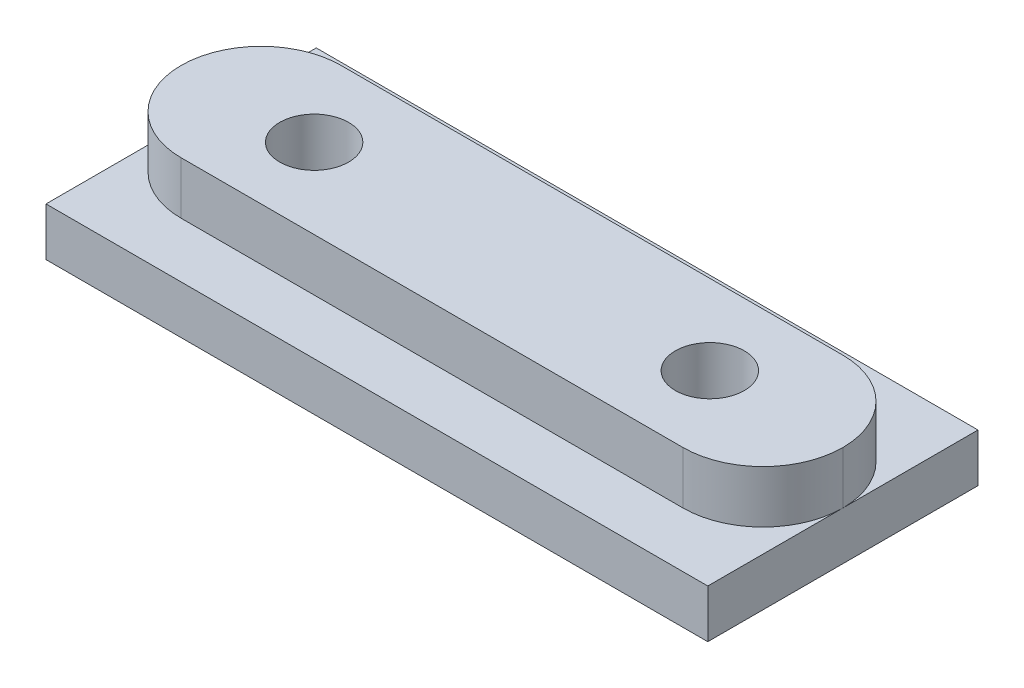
ISO-10303-21;
HEADER;
FILE_DESCRIPTION(('STEP AP214'),'2;1');
FILE_NAME('part.step','',(''),(''),'','','');
FILE_SCHEMA(('AUTOMOTIVE_DESIGN { 1 0 10303 214 1 1 1 1 }'));
ENDSEC;
DATA;
#1=APPLICATION_CONTEXT('core data for automotive mechanical design processes');
#2=APPLICATION_PROTOCOL_DEFINITION('international standard','automotive_design',2000,#1);
#3=PRODUCT_CONTEXT('',#1,'mechanical');
#4=PRODUCT('Part','Part','',(#3));
#5=PRODUCT_RELATED_PRODUCT_CATEGORY('part','',(#4));
#6=PRODUCT_DEFINITION_FORMATION('','',#4);
#7=PRODUCT_DEFINITION_CONTEXT('part definition',#1,'design');
#8=PRODUCT_DEFINITION('design','',#6,#7);
#9=PRODUCT_DEFINITION_SHAPE('','',#8);
#10=(LENGTH_UNIT() NAMED_UNIT(*) SI_UNIT(.MILLI.,.METRE.));
#11=(NAMED_UNIT(*) PLANE_ANGLE_UNIT() SI_UNIT($,.RADIAN.));
#12=(NAMED_UNIT(*) SI_UNIT($,.STERADIAN.) SOLID_ANGLE_UNIT());
#13=UNCERTAINTY_MEASURE_WITH_UNIT(LENGTH_MEASURE(1.E-05),#10,'distance_accuracy_value','');
#14=(GEOMETRIC_REPRESENTATION_CONTEXT(3) GLOBAL_UNCERTAINTY_ASSIGNED_CONTEXT((#13)) GLOBAL_UNIT_ASSIGNED_CONTEXT((#10,
#11,#12)) REPRESENTATION_CONTEXT('',''));
#15=CARTESIAN_POINT('',(0.,0.,0.));
#16=DIRECTION('',(0.,0.,1.));
#17=DIRECTION('',(1.,0.,0.));
#18=AXIS2_PLACEMENT_3D('',#15,#16,#17);
#19=CARTESIAN_POINT('',(24.,1.75,0.));
#20=DIRECTION('',(0.,0.,-1.));
#21=DIRECTION('',(-1.,0.,0.));
#22=AXIS2_PLACEMENT_3D('',#19,#20,#21);
#23=PLANE('',#22);
#24=DIRECTION('',(0.,-1.,0.));
#25=VECTOR('',#24,1.);
#26=CARTESIAN_POINT('',(0.,1.75,0.));
#27=LINE('',#26,#25);
#28=CARTESIAN_POINT('',(0.,1.75,0.));
#29=VERTEX_POINT('',#28);
#30=CARTESIAN_POINT('',(0.,0.,0.));
#31=VERTEX_POINT('',#30);
#32=EDGE_CURVE('E134',#29,#31,#27,.T.);
#33=ORIENTED_EDGE('',*,*,#32,.T.);
#34=DIRECTION('',(-1.,0.,0.));
#35=VECTOR('',#34,1.);
#36=CARTESIAN_POINT('',(24.,0.,0.));
#37=LINE('',#36,#35);
#38=CARTESIAN_POINT('',(24.,0.,0.));
#39=VERTEX_POINT('',#38);
#40=EDGE_CURVE('E118',#39,#31,#37,.T.);
#41=ORIENTED_EDGE('',*,*,#40,.F.);
#42=DIRECTION('',(0.,-1.,0.));
#43=VECTOR('',#42,1.);
#44=CARTESIAN_POINT('',(24.,1.75,0.));
#45=LINE('',#44,#43);
#46=CARTESIAN_POINT('',(24.,1.75,0.));
#47=VERTEX_POINT('',#46);
#48=EDGE_CURVE('E125',#47,#39,#45,.T.);
#49=ORIENTED_EDGE('',*,*,#48,.F.);
#50=DIRECTION('',(-1.,0.,0.));
#51=VECTOR('',#50,1.);
#52=CARTESIAN_POINT('',(24.,1.75,0.));
#53=LINE('',#52,#51);
#54=EDGE_CURVE('E188',#47,#29,#53,.T.);
#55=ORIENTED_EDGE('',*,*,#54,.T.);
#56=EDGE_LOOP('',(#33,#41,#49,#55));
#57=FACE_BOUND('',#56,.T.);
#58=ADVANCED_FACE('F34',(#57),#23,.F.);
#59=CARTESIAN_POINT('',(24.,0.,0.));
#60=DIRECTION('',(0.,1.,0.));
#61=DIRECTION('',(0.,0.,1.));
#62=AXIS2_PLACEMENT_3D('',#59,#60,#61);
#63=PLANE('',#62);
#64=CARTESIAN_POINT('',(4.825,0.,-4.9));
#65=DIRECTION('',(0.,1.,0.));
#66=DIRECTION('',(0.,0.,1.));
#67=AXIS2_PLACEMENT_3D('',#64,#65,#66);
#68=CIRCLE('',#67,1.25);
#69=CARTESIAN_POINT('',(4.825,0.,-3.65));
#70=VERTEX_POINT('',#69);
#71=EDGE_CURVE('E170',#70,#70,#68,.T.);
#72=ORIENTED_EDGE('',*,*,#71,.T.);
#73=EDGE_LOOP('',(#72));
#74=FACE_BOUND('',#73,.T.);
#75=CARTESIAN_POINT('',(19.175,0.,-4.9));
#76=DIRECTION('',(0.,1.,0.));
#77=DIRECTION('',(0.,0.,1.));
#78=AXIS2_PLACEMENT_3D('',#75,#76,#77);
#79=CIRCLE('',#78,1.25);
#80=CARTESIAN_POINT('',(19.175,0.,-3.65));
#81=VERTEX_POINT('',#80);
#82=EDGE_CURVE('E219',#81,#81,#79,.T.);
#83=ORIENTED_EDGE('',*,*,#82,.T.);
#84=EDGE_LOOP('',(#83));
#85=FACE_BOUND('',#84,.T.);
#86=DIRECTION('',(0.,0.,-1.));
#87=VECTOR('',#86,1.);
#88=CARTESIAN_POINT('',(0.,0.,0.));
#89=LINE('',#88,#87);
#90=CARTESIAN_POINT('',(0.,0.,-9.8));
#91=VERTEX_POINT('',#90);
#92=EDGE_CURVE('E214',#31,#91,#89,.T.);
#93=ORIENTED_EDGE('',*,*,#92,.T.);
#94=DIRECTION('',(-1.,0.,0.));
#95=VECTOR('',#94,1.);
#96=CARTESIAN_POINT('',(24.,0.,-9.8));
#97=LINE('',#96,#95);
#98=CARTESIAN_POINT('',(24.,0.,-9.8));
#99=VERTEX_POINT('',#98);
#100=EDGE_CURVE('E121',#99,#91,#97,.T.);
#101=ORIENTED_EDGE('',*,*,#100,.F.);
#102=DIRECTION('',(0.,0.,-1.));
#103=VECTOR('',#102,1.);
#104=CARTESIAN_POINT('',(24.,0.,0.));
#105=LINE('',#104,#103);
#106=EDGE_CURVE('E114',#39,#99,#105,.T.);
#107=ORIENTED_EDGE('',*,*,#106,.F.);
#108=ORIENTED_EDGE('',*,*,#40,.T.);
#109=EDGE_LOOP('',(#93,#101,#107,#108));
#110=FACE_BOUND('',#109,.T.);
#111=ADVANCED_FACE('F116',(#74,#85,#110),#63,.F.);
#112=CARTESIAN_POINT('',(24.,0.,-9.8));
#113=DIRECTION('',(0.,0.,1.));
#114=DIRECTION('',(0.,-1.,0.));
#115=AXIS2_PLACEMENT_3D('',#112,#113,#114);
#116=PLANE('',#115);
#117=DIRECTION('',(0.,1.,0.));
#118=VECTOR('',#117,1.);
#119=CARTESIAN_POINT('',(0.,0.,-9.8));
#120=LINE('',#119,#118);
#121=CARTESIAN_POINT('',(0.,1.75,-9.8));
#122=VERTEX_POINT('',#121);
#123=EDGE_CURVE('E212',#91,#122,#120,.T.);
#124=ORIENTED_EDGE('',*,*,#123,.T.);
#125=DIRECTION('',(-1.,0.,0.));
#126=VECTOR('',#125,1.);
#127=CARTESIAN_POINT('',(24.,1.75,-9.8));
#128=LINE('',#127,#126);
#129=CARTESIAN_POINT('',(24.,1.75,-9.8));
#130=VERTEX_POINT('',#129);
#131=EDGE_CURVE('E140',#130,#122,#128,.T.);
#132=ORIENTED_EDGE('',*,*,#131,.F.);
#133=DIRECTION('',(0.,1.,0.));
#134=VECTOR('',#133,1.);
#135=CARTESIAN_POINT('',(24.,0.,-9.8));
#136=LINE('',#135,#134);
#137=EDGE_CURVE('E124',#99,#130,#136,.T.);
#138=ORIENTED_EDGE('',*,*,#137,.F.);
#139=ORIENTED_EDGE('',*,*,#100,.T.);
#140=EDGE_LOOP('',(#124,#132,#138,#139));
#141=FACE_BOUND('',#140,.T.);
#142=ADVANCED_FACE('F267',(#141),#116,.F.);
#143=CARTESIAN_POINT('',(24.,1.75,-7.8));
#144=DIRECTION('',(0.,-1.,0.));
#145=DIRECTION('',(0.,0.,-1.));
#146=AXIS2_PLACEMENT_3D('',#143,#144,#145);
#147=PLANE('',#146);
#148=DIRECTION('',(0.,0.,1.));
#149=VECTOR('',#148,1.);
#150=CARTESIAN_POINT('',(0.,1.75,-7.8));
#151=LINE('',#150,#149);
#152=CARTESIAN_POINT('',(0.,1.75,-4.9));
#153=VERTEX_POINT('',#152);
#154=EDGE_CURVE('E206',#122,#153,#151,.T.);
#155=ORIENTED_EDGE('',*,*,#154,.T.);
#156=CARTESIAN_POINT('',(2.9,1.75,-4.9));
#157=DIRECTION('',(0.,-1.,0.));
#158=DIRECTION('',(0.,0.,-1.));
#159=AXIS2_PLACEMENT_3D('',#156,#157,#158);
#160=CIRCLE('',#159,2.9);
#161=CARTESIAN_POINT('',(2.9,1.75,-7.8));
#162=VERTEX_POINT('',#161);
#163=EDGE_CURVE('E157',#153,#162,#160,.T.);
#164=ORIENTED_EDGE('',*,*,#163,.T.);
#165=DIRECTION('',(-1.,0.,0.));
#166=VECTOR('',#165,1.);
#167=CARTESIAN_POINT('',(24.,1.75,-7.8));
#168=LINE('',#167,#166);
#169=CARTESIAN_POINT('',(21.1,1.75,-7.8));
#170=VERTEX_POINT('',#169);
#171=EDGE_CURVE('E197',#170,#162,#168,.T.);
#172=ORIENTED_EDGE('',*,*,#171,.F.);
#173=CARTESIAN_POINT('',(21.1,1.75,-4.9));
#174=DIRECTION('',(0.,-1.,0.));
#175=DIRECTION('',(0.,0.,-1.));
#176=AXIS2_PLACEMENT_3D('',#173,#174,#175);
#177=CIRCLE('',#176,2.9);
#178=CARTESIAN_POINT('',(24.,1.75,-4.9));
#179=VERTEX_POINT('',#178);
#180=EDGE_CURVE('E43',#170,#179,#177,.T.);
#181=ORIENTED_EDGE('',*,*,#180,.T.);
#182=DIRECTION('',(0.,0.,1.));
#183=VECTOR('',#182,1.);
#184=CARTESIAN_POINT('',(24.,1.75,-7.8));
#185=LINE('',#184,#183);
#186=EDGE_CURVE('E207',#130,#179,#185,.T.);
#187=ORIENTED_EDGE('',*,*,#186,.F.);
#188=ORIENTED_EDGE('',*,*,#131,.T.);
#189=EDGE_LOOP('',(#155,#164,#172,#181,#187,#188));
#190=FACE_BOUND('',#189,.T.);
#191=ADVANCED_FACE('F205',(#190),#147,.F.);
#192=CARTESIAN_POINT('',(24.,3.65,-7.8));
#193=DIRECTION('',(0.,0.,1.));
#194=DIRECTION('',(1.,0.,0.));
#195=AXIS2_PLACEMENT_3D('',#192,#193,#194);
#196=PLANE('',#195);
#197=ORIENTED_EDGE('',*,*,#171,.T.);
#198=DIRECTION('',(0.,1.,0.));
#199=VECTOR('',#198,1.);
#200=CARTESIAN_POINT('',(2.9,3.65,-7.8));
#201=LINE('',#200,#199);
#202=CARTESIAN_POINT('',(2.9,3.65,-7.8));
#203=VERTEX_POINT('',#202);
#204=EDGE_CURVE('E138',#162,#203,#201,.T.);
#205=ORIENTED_EDGE('',*,*,#204,.T.);
#206=DIRECTION('',(-1.,0.,0.));
#207=VECTOR('',#206,1.);
#208=CARTESIAN_POINT('',(24.,3.65,-7.8));
#209=LINE('',#208,#207);
#210=CARTESIAN_POINT('',(21.1,3.65,-7.8));
#211=VERTEX_POINT('',#210);
#212=EDGE_CURVE('E190',#211,#203,#209,.T.);
#213=ORIENTED_EDGE('',*,*,#212,.F.);
#214=DIRECTION('',(0.,1.,0.));
#215=VECTOR('',#214,1.);
#216=CARTESIAN_POINT('',(21.1,1.75,-7.8));
#217=LINE('',#216,#215);
#218=EDGE_CURVE('E135',#211,#170,#217,.F.);
#219=ORIENTED_EDGE('',*,*,#218,.T.);
#220=EDGE_LOOP('',(#197,#205,#213,#219));
#221=FACE_BOUND('',#220,.T.);
#222=ADVANCED_FACE('F244',(#221),#196,.F.);
#223=CARTESIAN_POINT('',(24.,3.65,-2.));
#224=DIRECTION('',(0.,-1.,0.));
#225=DIRECTION('',(0.,0.,-1.));
#226=AXIS2_PLACEMENT_3D('',#223,#224,#225);
#227=PLANE('',#226);
#228=CARTESIAN_POINT('',(4.825,3.65,-4.9));
#229=DIRECTION('',(0.,1.,0.));
#230=DIRECTION('',(0.,0.,1.));
#231=AXIS2_PLACEMENT_3D('',#228,#229,#230);
#232=CIRCLE('',#231,1.24999999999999);
#233=CARTESIAN_POINT('',(4.825,3.65,-3.65000000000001));
#234=VERTEX_POINT('',#233);
#235=EDGE_CURVE('E165',#234,#234,#232,.T.);
#236=ORIENTED_EDGE('',*,*,#235,.F.);
#237=EDGE_LOOP('',(#236));
#238=FACE_BOUND('',#237,.T.);
#239=CARTESIAN_POINT('',(19.175,3.65,-4.9));
#240=DIRECTION('',(0.,1.,0.));
#241=DIRECTION('',(0.,0.,1.));
#242=AXIS2_PLACEMENT_3D('',#239,#240,#241);
#243=CIRCLE('',#242,1.24999999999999);
#244=CARTESIAN_POINT('',(19.175,3.65,-3.65000000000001));
#245=VERTEX_POINT('',#244);
#246=EDGE_CURVE('E225',#245,#245,#243,.T.);
#247=ORIENTED_EDGE('',*,*,#246,.F.);
#248=EDGE_LOOP('',(#247));
#249=FACE_BOUND('',#248,.T.);
#250=ORIENTED_EDGE('',*,*,#212,.T.);
#251=CARTESIAN_POINT('',(2.9,3.65,-4.9));
#252=DIRECTION('',(0.,-1.,0.));
#253=DIRECTION('',(0.,0.,-1.));
#254=AXIS2_PLACEMENT_3D('',#251,#252,#253);
#255=CIRCLE('',#254,2.9);
#256=CARTESIAN_POINT('',(0.,3.65,-4.9));
#257=VERTEX_POINT('',#256);
#258=EDGE_CURVE('E152',#203,#257,#255,.F.);
#259=ORIENTED_EDGE('',*,*,#258,.T.);
#260=CARTESIAN_POINT('',(2.9,3.65,-4.9));
#261=DIRECTION('',(0.,-1.,0.));
#262=DIRECTION('',(0.,0.,-1.));
#263=AXIS2_PLACEMENT_3D('',#260,#261,#262);
#264=CIRCLE('',#263,2.9);
#265=CARTESIAN_POINT('',(2.9,3.65,-2.));
#266=VERTEX_POINT('',#265);
#267=EDGE_CURVE('E150',#257,#266,#264,.F.);
#268=ORIENTED_EDGE('',*,*,#267,.T.);
#269=DIRECTION('',(-1.,0.,0.));
#270=VECTOR('',#269,1.);
#271=CARTESIAN_POINT('',(24.,3.65,-2.));
#272=LINE('',#271,#270);
#273=CARTESIAN_POINT('',(21.1,3.65,-2.));
#274=VERTEX_POINT('',#273);
#275=EDGE_CURVE('E187',#274,#266,#272,.T.);
#276=ORIENTED_EDGE('',*,*,#275,.F.);
#277=CARTESIAN_POINT('',(21.1,3.65,-4.9));
#278=DIRECTION('',(0.,-1.,0.));
#279=DIRECTION('',(0.,0.,-1.));
#280=AXIS2_PLACEMENT_3D('',#277,#278,#279);
#281=CIRCLE('',#280,2.9);
#282=CARTESIAN_POINT('',(24.,3.65,-4.9));
#283=VERTEX_POINT('',#282);
#284=EDGE_CURVE('E146',#274,#283,#281,.F.);
#285=ORIENTED_EDGE('',*,*,#284,.T.);
#286=CARTESIAN_POINT('',(21.1,3.65,-4.9));
#287=DIRECTION('',(0.,-1.,0.));
#288=DIRECTION('',(0.,0.,-1.));
#289=AXIS2_PLACEMENT_3D('',#286,#287,#288);
#290=CIRCLE('',#289,2.9);
#291=EDGE_CURVE('E148',#283,#211,#290,.F.);
#292=ORIENTED_EDGE('',*,*,#291,.T.);
#293=EDGE_LOOP('',(#250,#259,#268,#276,#285,#292));
#294=FACE_BOUND('',#293,.T.);
#295=ADVANCED_FACE('F241',(#238,#249,#294),#227,.F.);
#296=CARTESIAN_POINT('',(24.,1.75,-2.));
#297=DIRECTION('',(0.,0.,-1.));
#298=DIRECTION('',(0.,1.,0.));
#299=AXIS2_PLACEMENT_3D('',#296,#297,#298);
#300=PLANE('',#299);
#301=ORIENTED_EDGE('',*,*,#275,.T.);
#302=DIRECTION('',(0.,-1.,0.));
#303=VECTOR('',#302,1.);
#304=CARTESIAN_POINT('',(2.9,1.75,-2.));
#305=LINE('',#304,#303);
#306=CARTESIAN_POINT('',(2.9,1.75,-2.));
#307=VERTEX_POINT('',#306);
#308=EDGE_CURVE('E58',#266,#307,#305,.T.);
#309=ORIENTED_EDGE('',*,*,#308,.T.);
#310=DIRECTION('',(-1.,0.,0.));
#311=VECTOR('',#310,1.);
#312=CARTESIAN_POINT('',(24.,1.75,-2.));
#313=LINE('',#312,#311);
#314=CARTESIAN_POINT('',(21.1,1.75,-2.));
#315=VERTEX_POINT('',#314);
#316=EDGE_CURVE('E183',#315,#307,#313,.T.);
#317=ORIENTED_EDGE('',*,*,#316,.F.);
#318=DIRECTION('',(0.,-1.,0.));
#319=VECTOR('',#318,1.);
#320=CARTESIAN_POINT('',(21.1,3.65,-2.));
#321=LINE('',#320,#319);
#322=EDGE_CURVE('E154',#315,#274,#321,.F.);
#323=ORIENTED_EDGE('',*,*,#322,.T.);
#324=EDGE_LOOP('',(#301,#309,#317,#323));
#325=FACE_BOUND('',#324,.T.);
#326=ADVANCED_FACE('F185',(#325),#300,.F.);
#327=CARTESIAN_POINT('',(24.,1.75,0.));
#328=DIRECTION('',(0.,-1.,0.));
#329=DIRECTION('',(0.,0.,-1.));
#330=AXIS2_PLACEMENT_3D('',#327,#328,#329);
#331=PLANE('',#330);
#332=DIRECTION('',(0.,0.,1.));
#333=VECTOR('',#332,1.);
#334=CARTESIAN_POINT('',(0.,1.75,0.));
#335=LINE('',#334,#333);
#336=EDGE_CURVE('E131',#153,#29,#335,.T.);
#337=ORIENTED_EDGE('',*,*,#336,.T.);
#338=ORIENTED_EDGE('',*,*,#54,.F.);
#339=DIRECTION('',(0.,0.,1.));
#340=VECTOR('',#339,1.);
#341=CARTESIAN_POINT('',(24.,1.75,0.));
#342=LINE('',#341,#340);
#343=EDGE_CURVE('E50',#179,#47,#342,.T.);
#344=ORIENTED_EDGE('',*,*,#343,.F.);
#345=CARTESIAN_POINT('',(21.1,1.75,-4.9));
#346=DIRECTION('',(0.,-1.,0.));
#347=DIRECTION('',(0.,0.,-1.));
#348=AXIS2_PLACEMENT_3D('',#345,#346,#347);
#349=CIRCLE('',#348,2.9);
#350=EDGE_CURVE('E11',#179,#315,#349,.T.);
#351=ORIENTED_EDGE('',*,*,#350,.T.);
#352=ORIENTED_EDGE('',*,*,#316,.T.);
#353=CARTESIAN_POINT('',(2.9,1.75,-4.9));
#354=DIRECTION('',(0.,-1.,0.));
#355=DIRECTION('',(0.,0.,-1.));
#356=AXIS2_PLACEMENT_3D('',#353,#354,#355);
#357=CIRCLE('',#356,2.9);
#358=EDGE_CURVE('E159',#307,#153,#357,.T.);
#359=ORIENTED_EDGE('',*,*,#358,.T.);
#360=EDGE_LOOP('',(#337,#338,#344,#351,#352,#359));
#361=FACE_BOUND('',#360,.T.);
#362=ADVANCED_FACE('F182',(#361),#331,.F.);
#363=CARTESIAN_POINT('',(24.,0.,0.));
#364=DIRECTION('',(1.,0.,0.));
#365=DIRECTION('',(0.,0.,-1.));
#366=AXIS2_PLACEMENT_3D('',#363,#364,#365);
#367=PLANE('',#366);
#368=ORIENTED_EDGE('',*,*,#186,.T.);
#369=ORIENTED_EDGE('',*,*,#343,.T.);
#370=ORIENTED_EDGE('',*,*,#48,.T.);
#371=ORIENTED_EDGE('',*,*,#106,.T.);
#372=ORIENTED_EDGE('',*,*,#137,.T.);
#373=EDGE_LOOP('',(#368,#369,#370,#371,#372));
#374=FACE_BOUND('',#373,.T.);
#375=ADVANCED_FACE('F128',(#374),#367,.T.);
#376=CARTESIAN_POINT('',(0.,0.,0.));
#377=DIRECTION('',(1.,0.,0.));
#378=DIRECTION('',(0.,0.,-1.));
#379=AXIS2_PLACEMENT_3D('',#376,#377,#378);
#380=PLANE('',#379);
#381=ORIENTED_EDGE('',*,*,#336,.F.);
#382=ORIENTED_EDGE('',*,*,#154,.F.);
#383=ORIENTED_EDGE('',*,*,#123,.F.);
#384=ORIENTED_EDGE('',*,*,#92,.F.);
#385=ORIENTED_EDGE('',*,*,#32,.F.);
#386=EDGE_LOOP('',(#381,#382,#383,#384,#385));
#387=FACE_BOUND('',#386,.T.);
#388=ADVANCED_FACE('F211',(#387),#380,.F.);
#389=CARTESIAN_POINT('',(19.175,3.65,-4.9));
#390=DIRECTION('',(0.,1.,0.));
#391=DIRECTION('',(0.,0.,1.));
#392=AXIS2_PLACEMENT_3D('',#389,#390,#391);
#393=CYLINDRICAL_SURFACE('',#392,1.24999999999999);
#394=ORIENTED_EDGE('',*,*,#82,.F.);
#395=EDGE_LOOP('',(#394));
#396=FACE_BOUND('',#395,.T.);
#397=ORIENTED_EDGE('',*,*,#246,.T.);
#398=EDGE_LOOP('',(#397));
#399=FACE_BOUND('',#398,.T.);
#400=ADVANCED_FACE('F237',(#396,#399),#393,.F.);
#401=CARTESIAN_POINT('',(4.825,3.65,-4.9));
#402=DIRECTION('',(0.,1.,0.));
#403=DIRECTION('',(0.,0.,1.));
#404=AXIS2_PLACEMENT_3D('',#401,#402,#403);
#405=CYLINDRICAL_SURFACE('',#404,1.24999999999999);
#406=ORIENTED_EDGE('',*,*,#71,.F.);
#407=EDGE_LOOP('',(#406));
#408=FACE_BOUND('',#407,.T.);
#409=ORIENTED_EDGE('',*,*,#235,.T.);
#410=EDGE_LOOP('',(#409));
#411=FACE_BOUND('',#410,.T.);
#412=ADVANCED_FACE('F233',(#408,#411),#405,.F.);
#413=CARTESIAN_POINT('',(2.9,1.75,-4.9));
#414=DIRECTION('',(0.,-1.,0.));
#415=DIRECTION('',(0.,0.,-1.));
#416=AXIS2_PLACEMENT_3D('',#413,#414,#415);
#417=CYLINDRICAL_SURFACE('',#416,2.9);
#418=DIRECTION('',(0.,-1.,0.));
#419=VECTOR('',#418,1.);
#420=CARTESIAN_POINT('',(0.,0.,-4.9));
#421=LINE('',#420,#419);
#422=EDGE_CURVE('E163',#153,#257,#421,.F.);
#423=ORIENTED_EDGE('',*,*,#422,.F.);
#424=ORIENTED_EDGE('',*,*,#358,.F.);
#425=ORIENTED_EDGE('',*,*,#308,.F.);
#426=ORIENTED_EDGE('',*,*,#267,.F.);
#427=EDGE_LOOP('',(#423,#424,#425,#426));
#428=FACE_BOUND('',#427,.T.);
#429=ADVANCED_FACE('F236',(#428),#417,.T.);
#430=CARTESIAN_POINT('',(2.9,3.65,-4.9));
#431=DIRECTION('',(0.,1.,0.));
#432=DIRECTION('',(0.,0.,1.));
#433=AXIS2_PLACEMENT_3D('',#430,#431,#432);
#434=CYLINDRICAL_SURFACE('',#433,2.9);
#435=ORIENTED_EDGE('',*,*,#163,.F.);
#436=ORIENTED_EDGE('',*,*,#422,.T.);
#437=ORIENTED_EDGE('',*,*,#258,.F.);
#438=ORIENTED_EDGE('',*,*,#204,.F.);
#439=EDGE_LOOP('',(#435,#436,#437,#438));
#440=FACE_BOUND('',#439,.T.);
#441=ADVANCED_FACE('F253',(#440),#434,.T.);
#442=CARTESIAN_POINT('',(21.1,0.,-4.9));
#443=DIRECTION('',(0.,1.,0.));
#444=DIRECTION('',(0.,0.,1.));
#445=AXIS2_PLACEMENT_3D('',#442,#443,#444);
#446=CYLINDRICAL_SURFACE('',#445,2.9);
#447=ORIENTED_EDGE('',*,*,#322,.F.);
#448=ORIENTED_EDGE('',*,*,#350,.F.);
#449=DIRECTION('',(0.,-1.,0.));
#450=VECTOR('',#449,1.);
#451=CARTESIAN_POINT('',(24.,1.75,-4.9));
#452=LINE('',#451,#450);
#453=EDGE_CURVE('E38',#283,#179,#452,.T.);
#454=ORIENTED_EDGE('',*,*,#453,.F.);
#455=ORIENTED_EDGE('',*,*,#284,.F.);
#456=EDGE_LOOP('',(#447,#448,#454,#455));
#457=FACE_BOUND('',#456,.T.);
#458=ADVANCED_FACE('F36',(#457),#446,.T.);
#459=CARTESIAN_POINT('',(21.1,0.,-4.9));
#460=DIRECTION('',(0.,-1.,0.));
#461=DIRECTION('',(0.,0.,-1.));
#462=AXIS2_PLACEMENT_3D('',#459,#460,#461);
#463=CYLINDRICAL_SURFACE('',#462,2.9);
#464=ORIENTED_EDGE('',*,*,#180,.F.);
#465=ORIENTED_EDGE('',*,*,#218,.F.);
#466=ORIENTED_EDGE('',*,*,#291,.F.);
#467=ORIENTED_EDGE('',*,*,#453,.T.);
#468=EDGE_LOOP('',(#464,#465,#466,#467));
#469=FACE_BOUND('',#468,.T.);
#470=ADVANCED_FACE('F176',(#469),#463,.T.);
#471=CLOSED_SHELL('',(#58,#111,#142,#191,#222,#295,#326,#362,#375,#388,#400,#412,#429,#441,#458,#470));
#472=MANIFOLD_SOLID_BREP('B2',#471);
#473=ADVANCED_BREP_SHAPE_REPRESENTATION('',(#18,#472),#14);
#474=SHAPE_DEFINITION_REPRESENTATION(#9,#473);
ENDSEC;
END-ISO-10303-21;
